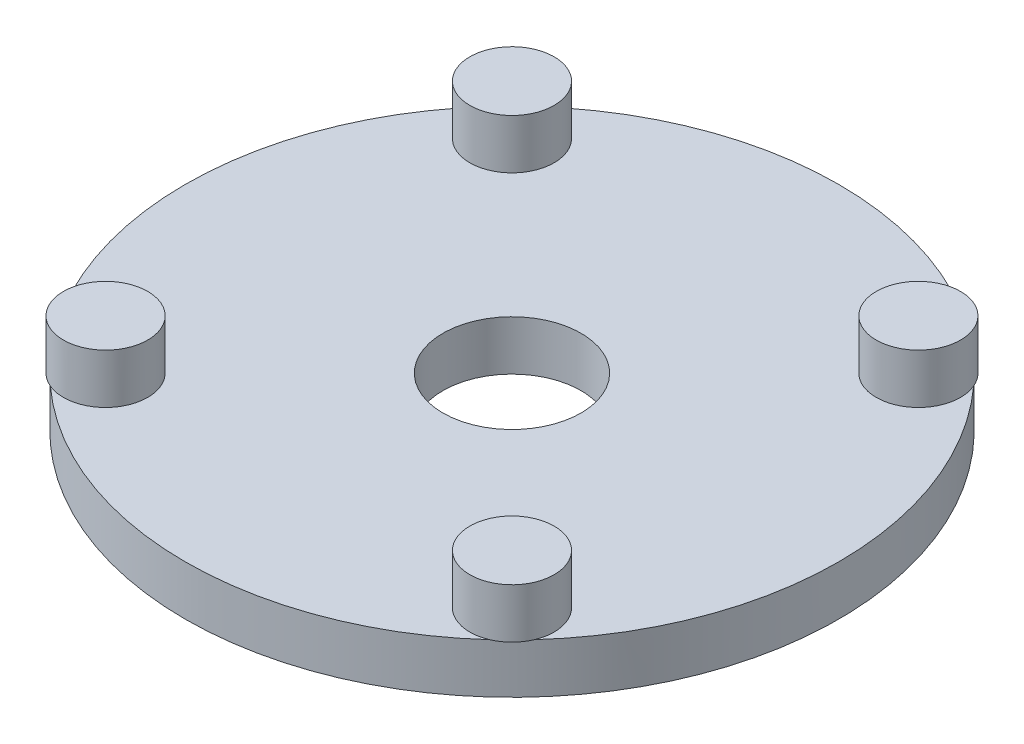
from build123d import *

# Parameters (mm, degrees)
SKETCH1_R           = 29
BOSS_EXTRUDE1_DEPTH = 4.41
SKETCH2_R           = 3.74
BOSS_EXTRUDE2_DEPTH = 4.41
CUT_EXTRUDE1_REACH  = 43.249
SKETCH3_R           = 6.13


with BuildPart() as part:
    # Sketch1 → Boss-Extrude1 (new body)
    with BuildSketch(Plane(origin=(0, 0, 0), x_dir=(1, 0, 0), z_dir=(0, 1, 0))):
        with Locations(Location((0, 0, 0), (0, 0, 270))):
            Circle(SKETCH1_R)
    extrude(amount=BOSS_EXTRUDE1_DEPTH)

    # Sketch2 → Boss-Extrude2 (add)
    with BuildSketch(Plane(origin=(0, 4.41, 0), x_dir=(1, 0, 0), z_dir=(0, 1, 0))):
        with Locations(Location((-18.03122292, 18.03122292, 0), (0, 0, 112.92902404))):
            Circle(SKETCH2_R)
        with Locations(Location((18.03122292, 18.03122292, 0), (0, 0, 67.07097596))):
            Circle(SKETCH2_R)
        with Locations(Location((18.03122292, -18.03122292, 0), (0, 0, 337.07097596))):
            Circle(SKETCH2_R)
        with Locations(Location((-18.03122292, -18.03122292, 0), (0, 0, 202.92902404))):
            Circle(SKETCH2_R)
    extrude(amount=BOSS_EXTRUDE2_DEPTH)

    # Sketch3 → Cut-Extrude1 (cut, up to next)
    with BuildSketch(Plane(origin=(0, 4.41, 0), x_dir=(1, 0, 0), z_dir=(0, 1, 0)), mode=Mode.PRIVATE) as cut_extrude1_sk1:
        with Locations(Location((0, 0, 0), (0, 0, 270))):
            Circle(SKETCH3_R)
    cut_extrude1_tool1 = extrude(cut_extrude1_sk1.sketch, amount=-CUT_EXTRUDE1_REACH, mode=Mode.PRIVATE) & part.part
    add(cut_extrude1_tool1.solids().sort_by_distance((0, 4.41, 0))[0], mode=Mode.SUBTRACT)


solid = part.part
